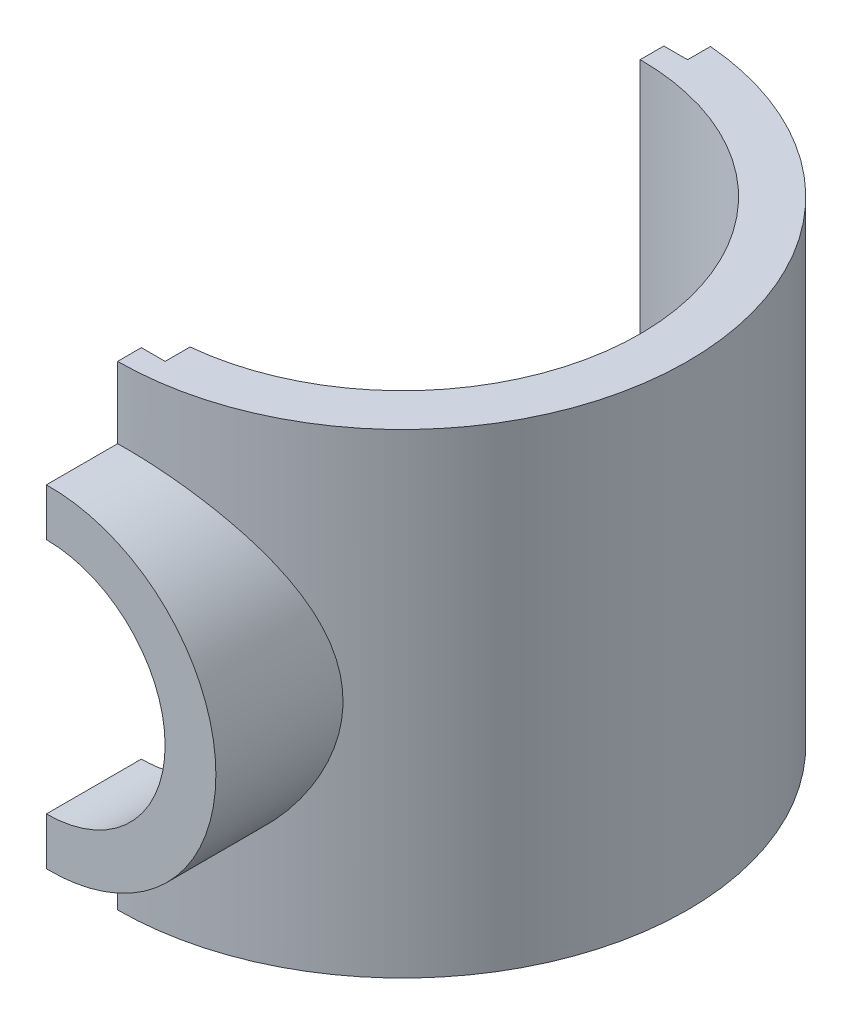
ISO-10303-21;
HEADER;
FILE_DESCRIPTION(('STEP AP214'),'2;1');
FILE_NAME('part.step','',(''),(''),'','','');
FILE_SCHEMA(('AUTOMOTIVE_DESIGN { 1 0 10303 214 1 1 1 1 }'));
ENDSEC;
DATA;
#1=APPLICATION_CONTEXT('core data for automotive mechanical design processes');
#2=APPLICATION_PROTOCOL_DEFINITION('international standard','automotive_design',2000,#1);
#3=PRODUCT_CONTEXT('',#1,'mechanical');
#4=PRODUCT('Part','Part','',(#3));
#5=PRODUCT_RELATED_PRODUCT_CATEGORY('part','',(#4));
#6=PRODUCT_DEFINITION_FORMATION('','',#4);
#7=PRODUCT_DEFINITION_CONTEXT('part definition',#1,'design');
#8=PRODUCT_DEFINITION('design','',#6,#7);
#9=PRODUCT_DEFINITION_SHAPE('','',#8);
#10=(LENGTH_UNIT() NAMED_UNIT(*) SI_UNIT(.MILLI.,.METRE.));
#11=(NAMED_UNIT(*) PLANE_ANGLE_UNIT() SI_UNIT($,.RADIAN.));
#12=(NAMED_UNIT(*) SI_UNIT($,.STERADIAN.) SOLID_ANGLE_UNIT());
#13=UNCERTAINTY_MEASURE_WITH_UNIT(LENGTH_MEASURE(1.E-05),#10,'distance_accuracy_value','');
#14=(GEOMETRIC_REPRESENTATION_CONTEXT(3) GLOBAL_UNCERTAINTY_ASSIGNED_CONTEXT((#13)) GLOBAL_UNIT_ASSIGNED_CONTEXT((#10,
#11,#12)) REPRESENTATION_CONTEXT('',''));
#15=CARTESIAN_POINT('',(0.,0.,0.));
#16=DIRECTION('',(0.,0.,1.));
#17=DIRECTION('',(1.,0.,0.));
#18=AXIS2_PLACEMENT_3D('',#15,#16,#17);
#19=CARTESIAN_POINT('',(0.,20.,10.));
#20=DIRECTION('',(1.,0.,0.));
#21=DIRECTION('',(0.,0.,-1.));
#22=AXIS2_PLACEMENT_3D('',#19,#20,#21);
#23=PLANE('',#22);
#24=DIRECTION('',(0.,1.,0.));
#25=VECTOR('',#24,1.);
#26=CARTESIAN_POINT('',(0.,20.,10.9995625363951));
#27=LINE('',#26,#25);
#28=CARTESIAN_POINT('',(0.,15.,10.9995625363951));
#29=VERTEX_POINT('',#28);
#30=CARTESIAN_POINT('',(0.,20.,10.9995625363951));
#31=VERTEX_POINT('',#30);
#32=EDGE_CURVE('E169',#29,#31,#27,.T.);
#33=ORIENTED_EDGE('',*,*,#32,.F.);
#34=DIRECTION('',(0.,0.,-1.));
#35=VECTOR('',#34,1.);
#36=CARTESIAN_POINT('',(0.,15.,15.));
#37=LINE('',#36,#35);
#38=CARTESIAN_POINT('',(0.,15.,15.));
#39=VERTEX_POINT('',#38);
#40=EDGE_CURVE('E254',#39,#29,#37,.T.);
#41=ORIENTED_EDGE('',*,*,#40,.F.);
#42=DIRECTION('',(0.,-1.,0.));
#43=VECTOR('',#42,1.);
#44=CARTESIAN_POINT('',(0.,16.998648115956,15.));
#45=LINE('',#44,#43);
#46=CARTESIAN_POINT('',(0.,16.998648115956,15.));
#47=VERTEX_POINT('',#46);
#48=EDGE_CURVE('E296',#47,#39,#45,.T.);
#49=ORIENTED_EDGE('',*,*,#48,.F.);
#50=DIRECTION('',(0.,0.,-1.));
#51=VECTOR('',#50,1.);
#52=CARTESIAN_POINT('',(0.,16.998648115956,15.));
#53=LINE('',#52,#51);
#54=CARTESIAN_POINT('',(0.,16.998648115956,12.));
#55=VERTEX_POINT('',#54);
#56=EDGE_CURVE('E217',#47,#55,#53,.T.);
#57=ORIENTED_EDGE('',*,*,#56,.T.);
#58=DIRECTION('',(0.,-1.,0.));
#59=VECTOR('',#58,1.);
#60=CARTESIAN_POINT('',(0.,20.,12.));
#61=LINE('',#60,#59);
#62=CARTESIAN_POINT('',(0.,20.,12.));
#63=VERTEX_POINT('',#62);
#64=EDGE_CURVE('E240',#63,#55,#61,.T.);
#65=ORIENTED_EDGE('',*,*,#64,.F.);
#66=DIRECTION('',(0.,0.,1.));
#67=VECTOR('',#66,1.);
#68=CARTESIAN_POINT('',(0.,20.,10.));
#69=LINE('',#68,#67);
#70=EDGE_CURVE('E222',#31,#63,#69,.T.);
#71=ORIENTED_EDGE('',*,*,#70,.F.);
#72=EDGE_LOOP('',(#33,#41,#49,#57,#65,#71));
#73=FACE_BOUND('',#72,.T.);
#74=ADVANCED_FACE('F33',(#73),#23,.F.);
#75=CARTESIAN_POINT('',(0.,20.,0.));
#76=DIRECTION('',(0.,-1.,0.));
#77=DIRECTION('',(0.,0.,-1.));
#78=AXIS2_PLACEMENT_3D('',#75,#76,#77);
#79=CYLINDRICAL_SURFACE('',#78,10.);
#80=DIRECTION('',(0.,-1.,0.));
#81=VECTOR('',#80,1.);
#82=CARTESIAN_POINT('',(1.,20.,9.9498743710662));
#83=LINE('',#82,#81);
#84=CARTESIAN_POINT('',(1.,20.,9.9498743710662));
#85=VERTEX_POINT('',#84);
#86=CARTESIAN_POINT('',(1.,14.8989794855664,9.9498743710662));
#87=VERTEX_POINT('',#86);
#88=EDGE_CURVE('E171',#85,#87,#83,.T.);
#89=ORIENTED_EDGE('',*,*,#88,.F.);
#90=CARTESIAN_POINT('',(0.,20.,0.));
#91=DIRECTION('',(0.,-1.,0.));
#92=DIRECTION('',(0.,0.,1.));
#93=AXIS2_PLACEMENT_3D('',#90,#91,#92);
#94=CIRCLE('',#93,10.);
#95=CARTESIAN_POINT('',(0.,20.,-10.));
#96=VERTEX_POINT('',#95);
#97=EDGE_CURVE('E219',#96,#85,#94,.T.);
#98=ORIENTED_EDGE('',*,*,#97,.F.);
#99=DIRECTION('',(0.,-1.,0.));
#100=VECTOR('',#99,1.);
#101=CARTESIAN_POINT('',(0.,20.,-10.));
#102=LINE('',#101,#100);
#103=CARTESIAN_POINT('',(0.,0.,-10.));
#104=VERTEX_POINT('',#103);
#105=EDGE_CURVE('E228',#96,#104,#102,.T.);
#106=ORIENTED_EDGE('',*,*,#105,.T.);
#107=CARTESIAN_POINT('',(0.,0.,0.));
#108=DIRECTION('',(0.,-1.,0.));
#109=DIRECTION('',(0.,0.,1.));
#110=AXIS2_PLACEMENT_3D('',#107,#108,#109);
#111=CIRCLE('',#110,10.);
#112=CARTESIAN_POINT('',(1.,0.,9.9498743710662));
#113=VERTEX_POINT('',#112);
#114=EDGE_CURVE('E216',#104,#113,#111,.T.);
#115=ORIENTED_EDGE('',*,*,#114,.T.);
#116=CARTESIAN_POINT('',(1.,5.10102051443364,9.9498743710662));
#117=VERTEX_POINT('',#116);
#118=EDGE_CURVE('E173',#117,#113,#83,.T.);
#119=ORIENTED_EDGE('',*,*,#118,.F.);
#120=CARTESIAN_POINT('',(0.,5.,10.));
#121=CARTESIAN_POINT('',(0.131987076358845,4.9999776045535,10.0000241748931));
#122=CARTESIAN_POINT('',(0.2639623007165,5.0052251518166,9.99738782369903));
#123=CARTESIAN_POINT('',(0.526834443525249,5.02609185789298,9.98697207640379));
#124=CARTESIAN_POINT('',(0.657731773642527,5.04170685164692,9.97919474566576));
#125=CARTESIAN_POINT('',(0.916915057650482,5.08304694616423,9.9587210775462));
#126=CARTESIAN_POINT('',(1.04521012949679,5.10872611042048,9.94604709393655));
#127=CARTESIAN_POINT('',(1.29889259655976,5.16989629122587,9.91610743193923));
#128=CARTESIAN_POINT('',(1.42427981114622,5.20538791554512,9.89884146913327));
#129=CARTESIAN_POINT('',(1.67114695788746,5.28575657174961,9.86016491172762));
#130=CARTESIAN_POINT('',(1.79263227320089,5.33061997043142,9.83876034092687));
#131=CARTESIAN_POINT('',(2.03118834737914,5.4293369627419,9.79229658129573));
#132=CARTESIAN_POINT('',(2.14825742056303,5.48319394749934,9.76723601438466));
#133=CARTESIAN_POINT('',(2.49198806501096,5.65765500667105,9.68737302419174));
#134=CARTESIAN_POINT('',(2.7111764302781,5.79115029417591,9.62788876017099));
#135=CARTESIAN_POINT('',(3.13759208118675,6.09761359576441,9.49780310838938));
#136=CARTESIAN_POINT('',(3.34331339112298,6.27246892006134,9.42674891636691));
#137=CARTESIAN_POINT('',(3.7238994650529,6.65261040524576,9.28299460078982));
#138=CARTESIAN_POINT('',(3.89874394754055,6.85791640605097,9.21029343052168));
#139=CARTESIAN_POINT('',(4.22628588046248,7.31247794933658,9.06493777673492));
#140=CARTESIAN_POINT('',(4.37621092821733,7.56390789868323,8.99272491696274));
#141=CARTESIAN_POINT('',(4.56723713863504,7.95992598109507,8.89637237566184));
#142=CARTESIAN_POINT('',(4.62528235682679,8.09512461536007,8.8662414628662));
#143=CARTESIAN_POINT('',(4.72948947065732,8.37100440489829,8.81109555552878));
#144=CARTESIAN_POINT('',(4.77565838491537,8.51168226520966,8.78607754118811));
#145=CARTESIAN_POINT('',(4.85313763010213,8.78899122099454,8.74350585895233));
#146=CARTESIAN_POINT('',(4.88516689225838,8.92536736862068,8.72559744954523));
#147=CARTESIAN_POINT('',(4.93772467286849,9.20091938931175,8.69596394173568));
#148=CARTESIAN_POINT('',(4.95825929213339,9.34009373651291,8.68423556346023));
#149=CARTESIAN_POINT('',(4.98752342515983,9.61999946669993,8.6674619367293));
#150=CARTESIAN_POINT('',(4.99625978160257,9.76072989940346,8.66241281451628));
#151=CARTESIAN_POINT('',(5.00180406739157,10.042497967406,8.65921295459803));
#152=CARTESIAN_POINT('',(4.99861313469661,10.1835355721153,8.66106155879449));
#153=CARTESIAN_POINT('',(4.98145794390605,10.4477049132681,8.67093732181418));
#154=CARTESIAN_POINT('',(4.96883180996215,10.5709552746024,8.67819679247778));
#155=CARTESIAN_POINT('',(4.93454318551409,10.8158265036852,8.69773954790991));
#156=CARTESIAN_POINT('',(4.91287785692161,10.9374468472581,8.71002441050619));
#157=CARTESIAN_POINT('',(4.86076118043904,11.1782043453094,8.73921568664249));
#158=CARTESIAN_POINT('',(4.83031110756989,11.2973418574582,8.75612142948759));
#159=CARTESIAN_POINT('',(4.76094234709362,11.5324738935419,8.79403119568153));
#160=CARTESIAN_POINT('',(4.72202033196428,11.6484671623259,8.8150368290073));
#161=CARTESIAN_POINT('',(4.59108782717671,11.9960036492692,8.88435968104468));
#162=CARTESIAN_POINT('',(4.48609075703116,12.2216871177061,8.93828642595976));
#163=CARTESIAN_POINT('',(4.24519967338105,12.653204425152,9.0551725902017));
#164=CARTESIAN_POINT('',(4.10929093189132,12.8590287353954,9.11813630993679));
#165=CARTESIAN_POINT('',(3.79034940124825,13.2725817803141,9.25565231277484));
#166=CARTESIAN_POINT('',(3.60352713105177,13.4772453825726,9.33066191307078));
#167=CARTESIAN_POINT('',(3.19774809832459,13.8536928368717,9.47738570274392));
#168=CARTESIAN_POINT('',(2.97877409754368,14.0254589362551,9.54909809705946));
#169=CARTESIAN_POINT('',(2.62424290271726,14.2584822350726,9.65036302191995));
#170=CARTESIAN_POINT('',(2.49857972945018,14.3334294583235,9.6837382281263));
#171=CARTESIAN_POINT('',(2.24044358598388,14.4723446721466,9.74669300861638));
#172=CARTESIAN_POINT('',(2.10797363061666,14.5363174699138,9.77627424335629));
#173=CARTESIAN_POINT('',(1.83725781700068,14.6525425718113,9.83074360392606));
#174=CARTESIAN_POINT('',(1.69901955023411,14.7048097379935,9.8556376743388));
#175=CARTESIAN_POINT('',(1.4177375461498,14.7970756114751,9.90001531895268));
#176=CARTESIAN_POINT('',(1.27469565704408,14.8370789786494,9.91950094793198));
#177=CARTESIAN_POINT('',(0.945577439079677,14.9134074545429,9.95691496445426));
#178=CARTESIAN_POINT('',(0.758343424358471,14.9457982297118,9.97299046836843));
#179=CARTESIAN_POINT('',(0.475251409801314,14.9782726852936,9.98915036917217));
#180=CARTESIAN_POINT('',(0.380459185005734,14.9864122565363,9.99321148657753));
#181=CARTESIAN_POINT('',(0.190454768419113,14.9972773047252,9.99863828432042));
#182=CARTESIAN_POINT('',(0.0952424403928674,15.00000087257,10.0000030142));
#183=CARTESIAN_POINT('',(0.,15.,10.));
#184=B_SPLINE_CURVE_WITH_KNOTS('',3,(#120,#121,#122,#123,#124,#125,#126,#127,#128,#129,#130,
#131,#132,#133,#134,#135,#136,#137,#138,#139,#140,#141,#142,#143,#144,#145,#146,#147,#148,#149,
#150,#151,#152,#153,#154,#155,#156,#157,#158,#159,#160,#161,#162,#163,#164,#165,#166,#167,#168,
#169,#170,#171,#172,#173,#174,#175,#176,#177,#178,#179,#180,#181,#182,#183),.UNSPECIFIED.,.F.,
.F.,(4,2,2,2,2,2,2,2,2,2,2,2,2,2,2,2,2,2,2,2,2,2,2,2,2,2,2,2,2,2,2,4),(0.,0.395812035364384,
0.791465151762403,1.1853330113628,1.57922527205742,1.97254847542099,2.36602032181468,
3.15295337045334,3.98708662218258,4.82176575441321,5.72123159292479,6.17125755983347,
6.62101695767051,7.04409748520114,7.4669532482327,7.88956366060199,8.31213375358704,
8.68401829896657,9.05601969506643,9.42796712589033,9.80006091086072,10.5608222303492,
11.3219467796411,12.1795413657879,13.0375974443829,13.4873137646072,13.9368325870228,
14.385777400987,14.834551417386,15.4049367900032,15.6904554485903,15.9760747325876),.UNSPECIFIED.);
#185=EDGE_CURVE('E177',#117,#87,#184,.T.);
#186=ORIENTED_EDGE('',*,*,#185,.T.);
#187=EDGE_LOOP('',(#89,#98,#106,#115,#119,#186));
#188=FACE_BOUND('',#187,.T.);
#189=ADVANCED_FACE('F35',(#188),#79,.F.);
#190=DIRECTION('',(0.,1.,0.));
#191=VECTOR('',#190,1.);
#192=CARTESIAN_POINT('',(0.,20.,10.9995625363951));
#193=LINE('',#192,#191);
#194=CARTESIAN_POINT('',(0.,0.,10.9995625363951));
#195=VERTEX_POINT('',#194);
#196=CARTESIAN_POINT('',(0.,5.,10.9995625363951));
#197=VERTEX_POINT('',#196);
#198=EDGE_CURVE('E147',#195,#197,#193,.T.);
#199=ORIENTED_EDGE('',*,*,#198,.F.);
#200=DIRECTION('',(0.,0.,1.));
#201=VECTOR('',#200,1.);
#202=CARTESIAN_POINT('',(0.,0.,10.));
#203=LINE('',#202,#201);
#204=CARTESIAN_POINT('',(0.,0.,12.));
#205=VERTEX_POINT('',#204);
#206=EDGE_CURVE('E231',#195,#205,#203,.T.);
#207=ORIENTED_EDGE('',*,*,#206,.T.);
#208=CARTESIAN_POINT('',(0.,3.00135188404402,12.));
#209=VERTEX_POINT('',#208);
#210=EDGE_CURVE('E239',#209,#205,#61,.T.);
#211=ORIENTED_EDGE('',*,*,#210,.F.);
#212=DIRECTION('',(0.,0.,-1.));
#213=VECTOR('',#212,1.);
#214=CARTESIAN_POINT('',(0.,3.00135188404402,15.));
#215=LINE('',#214,#213);
#216=CARTESIAN_POINT('',(0.,3.00135188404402,15.));
#217=VERTEX_POINT('',#216);
#218=EDGE_CURVE('E289',#217,#209,#215,.T.);
#219=ORIENTED_EDGE('',*,*,#218,.F.);
#220=DIRECTION('',(0.,-1.,0.));
#221=VECTOR('',#220,1.);
#222=CARTESIAN_POINT('',(0.,5.,15.));
#223=LINE('',#222,#221);
#224=CARTESIAN_POINT('',(0.,5.,15.));
#225=VERTEX_POINT('',#224);
#226=EDGE_CURVE('E288',#225,#217,#223,.T.);
#227=ORIENTED_EDGE('',*,*,#226,.F.);
#228=DIRECTION('',(0.,0.,-1.));
#229=VECTOR('',#228,1.);
#230=CARTESIAN_POINT('',(0.,5.,15.));
#231=LINE('',#230,#229);
#232=EDGE_CURVE('E281',#225,#197,#231,.T.);
#233=ORIENTED_EDGE('',*,*,#232,.T.);
#234=EDGE_LOOP('',(#199,#207,#211,#219,#227,#233));
#235=FACE_BOUND('',#234,.T.);
#236=ADVANCED_FACE('F286',(#235),#23,.F.);
#237=CARTESIAN_POINT('',(0.,20.,0.));
#238=DIRECTION('',(0.,-1.,0.));
#239=DIRECTION('',(0.,0.,-1.));
#240=AXIS2_PLACEMENT_3D('',#237,#238,#239);
#241=CYLINDRICAL_SURFACE('',#240,12.);
#242=DIRECTION('',(0.,-1.,0.));
#243=VECTOR('',#242,1.);
#244=CARTESIAN_POINT('',(1.,20.,-11.9582607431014));
#245=LINE('',#244,#243);
#246=CARTESIAN_POINT('',(1.,20.,-11.9582607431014));
#247=VERTEX_POINT('',#246);
#248=CARTESIAN_POINT('',(1.,0.,-11.9582607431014));
#249=VERTEX_POINT('',#248);
#250=EDGE_CURVE('E175',#247,#249,#245,.T.);
#251=ORIENTED_EDGE('',*,*,#250,.F.);
#252=CARTESIAN_POINT('',(0.,20.,0.));
#253=DIRECTION('',(0.,1.,0.));
#254=DIRECTION('',(0.,0.,1.));
#255=AXIS2_PLACEMENT_3D('',#252,#253,#254);
#256=CIRCLE('',#255,12.);
#257=EDGE_CURVE('E152',#63,#247,#256,.T.);
#258=ORIENTED_EDGE('',*,*,#257,.F.);
#259=ORIENTED_EDGE('',*,*,#64,.T.);
#260=CARTESIAN_POINT('',(0.,3.00135188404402,12.));
#261=CARTESIAN_POINT('',(0.180325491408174,2.99777360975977,12.0000367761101));
#262=CARTESIAN_POINT('',(0.36077167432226,3.00123102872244,11.9959367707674));
#263=CARTESIAN_POINT('',(0.720420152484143,3.02199289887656,11.9796972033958));
#264=CARTESIAN_POINT('',(0.899622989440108,3.03929088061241,11.9675613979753));
#265=CARTESIAN_POINT('',(1.25452167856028,3.08737801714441,11.9355693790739));
#266=CARTESIAN_POINT('',(1.43023113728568,3.11809472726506,11.9157546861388));
#267=CARTESIAN_POINT('',(1.77787507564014,3.19257846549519,11.8688633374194));
#268=CARTESIAN_POINT('',(1.94980927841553,3.23634644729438,11.8417861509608));
#269=CARTESIAN_POINT('',(2.28848357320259,3.33631708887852,11.7810179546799));
#270=CARTESIAN_POINT('',(2.45523225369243,3.39249778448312,11.7473386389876));
#271=CARTESIAN_POINT('',(2.78292915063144,3.51672876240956,11.6740546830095));
#272=CARTESIAN_POINT('',(2.94387509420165,3.58478363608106,11.6344477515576));
#273=CARTESIAN_POINT('',(3.41695165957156,3.8059144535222,11.507857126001));
#274=CARTESIAN_POINT('',(3.71927998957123,3.97594431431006,11.4131112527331));
#275=CARTESIAN_POINT('',(4.31302273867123,4.36957274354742,11.202870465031));
#276=CARTESIAN_POINT('',(4.60207997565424,4.59614901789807,11.0863722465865));
#277=CARTESIAN_POINT('',(5.14047439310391,5.09036788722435,10.8472237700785));
#278=CARTESIAN_POINT('',(5.38976913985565,5.35805376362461,10.7245671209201));
#279=CARTESIAN_POINT('',(5.74454120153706,5.80430498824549,10.5366584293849));
#280=CARTESIAN_POINT('',(5.86512575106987,5.97043611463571,10.4698337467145));
#281=CARTESIAN_POINT('',(6.09182603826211,6.31366400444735,10.3395704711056));
#282=CARTESIAN_POINT('',(6.19793946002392,6.49076251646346,10.2761324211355));
#283=CARTESIAN_POINT('',(6.39466440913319,6.85492213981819,10.1548814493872));
#284=CARTESIAN_POINT('',(6.48529382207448,7.0419714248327,10.0970620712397));
#285=CARTESIAN_POINT('',(6.65019642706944,7.42528849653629,9.98922419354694));
#286=CARTESIAN_POINT('',(6.7244752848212,7.62155306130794,9.9392029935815));
#287=CARTESIAN_POINT('',(6.84038256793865,7.97553883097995,9.85965991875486));
#288=CARTESIAN_POINT('',(6.8855877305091,8.13163322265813,9.82807480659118));
#289=CARTESIAN_POINT('',(6.96523588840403,8.44774905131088,9.77178960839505));
#290=CARTESIAN_POINT('',(6.99968122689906,8.60776962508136,9.74708802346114));
#291=CARTESIAN_POINT('',(7.05734654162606,8.93064997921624,9.70541747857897));
#292=CARTESIAN_POINT('',(7.08057810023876,9.09350664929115,9.68844054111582));
#293=CARTESIAN_POINT('',(7.11553336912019,9.42111128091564,9.66279764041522));
#294=CARTESIAN_POINT('',(7.12725691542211,9.585859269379,9.65413179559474));
#295=CARTESIAN_POINT('',(7.13902580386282,9.91641475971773,9.6454323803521));
#296=CARTESIAN_POINT('',(7.13904193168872,10.0822238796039,9.64542040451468));
#297=CARTESIAN_POINT('',(7.12732264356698,10.4131955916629,9.65408326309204));
#298=CARTESIAN_POINT('',(7.11558718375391,10.57835818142,9.66275812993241));
#299=CARTESIAN_POINT('',(7.08054307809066,10.9068477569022,9.68846626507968));
#300=CARTESIAN_POINT('',(7.05723007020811,11.070174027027,9.70550268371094));
#301=CARTESIAN_POINT('',(6.99935758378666,11.3938692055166,9.74732085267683));
#302=CARTESIAN_POINT('',(6.9647935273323,11.5542368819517,9.77210575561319));
#303=CARTESIAN_POINT('',(6.8858490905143,11.8671014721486,9.82788661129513));
#304=CARTESIAN_POINT('',(6.84173132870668,12.0196949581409,9.85871463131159));
#305=CARTESIAN_POINT('',(6.74367299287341,12.3204293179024,9.92604691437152));
#306=CARTESIAN_POINT('',(6.68972921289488,12.4685687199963,9.96255302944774));
#307=CARTESIAN_POINT('',(6.51387357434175,12.9053723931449,10.0791493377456));
#308=CARTESIAN_POINT('',(6.37789731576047,13.1865786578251,10.1663470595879));
#309=CARTESIAN_POINT('',(6.04668487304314,13.7699650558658,10.3672978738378));
#310=CARTESIAN_POINT('',(5.84538401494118,14.0680056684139,10.4830603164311));
#311=CARTESIAN_POINT('',(5.51204738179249,14.4885430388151,10.659890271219));
#312=CARTESIAN_POINT('',(5.39560948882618,14.624389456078,10.7194084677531));
#313=CARTESIAN_POINT('',(5.15260030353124,14.8868614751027,10.8383110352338));
#314=CARTESIAN_POINT('',(5.02602731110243,15.0134855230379,10.8976953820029));
#315=CARTESIAN_POINT('',(4.74395459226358,15.2747861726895,11.0237073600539));
#316=CARTESIAN_POINT('',(4.58693313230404,15.4079266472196,11.090122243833));
#317=CARTESIAN_POINT('',(4.26090585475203,15.6604387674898,11.2194215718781));
#318=CARTESIAN_POINT('',(4.09190406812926,15.7798150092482,11.2823071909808));
#319=CARTESIAN_POINT('',(3.74257913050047,16.0039121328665,11.4029495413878));
#320=CARTESIAN_POINT('',(3.56225084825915,16.1086263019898,11.4607039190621));
#321=CARTESIAN_POINT('',(3.19135831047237,16.3022297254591,11.5694667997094));
#322=CARTESIAN_POINT('',(3.00079556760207,16.3911213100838,11.620476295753));
#323=CARTESIAN_POINT('',(2.61993026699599,16.5481498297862,11.7120660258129));
#324=CARTESIAN_POINT('',(2.43004252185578,16.6170701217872,11.7530256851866));
#325=CARTESIAN_POINT('',(2.04351336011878,16.7385745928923,11.8263572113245));
#326=CARTESIAN_POINT('',(1.84687321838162,16.7911618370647,11.8587306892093));
#327=CARTESIAN_POINT('',(1.44901683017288,16.8790622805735,11.9138818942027));
#328=CARTESIAN_POINT('',(1.24781437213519,16.9144217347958,11.9366852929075));
#329=CARTESIAN_POINT('',(0.842319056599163,16.9674287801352,11.9721277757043));
#330=CARTESIAN_POINT('',(0.638028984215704,16.9850914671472,11.9847755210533));
#331=CARTESIAN_POINT('',(0.361083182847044,16.9968044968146,11.9947845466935));
#332=CARTESIAN_POINT('',(0.288845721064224,16.9987386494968,11.9967411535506));
#333=CARTESIAN_POINT('',(0.144401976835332,17.0003684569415,11.9993480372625));
#334=CARTESIAN_POINT('',(0.0721957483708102,17.0000665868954,11.9999997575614));
#335=CARTESIAN_POINT('',(0.,16.998648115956,12.));
#336=B_SPLINE_CURVE_WITH_KNOTS('',3,(#260,#261,#262,#263,#264,#265,#266,#267,#268,#269,#270,
#271,#272,#273,#274,#275,#276,#277,#278,#279,#280,#281,#282,#283,#284,#285,#286,#287,#288,#289,
#290,#291,#292,#293,#294,#295,#296,#297,#298,#299,#300,#301,#302,#303,#304,#305,#306,#307,#308,
#309,#310,#311,#312,#313,#314,#315,#316,#317,#318,#319,#320,#321,#322,#323,#324,#325,#326,#327,
#328,#329,#330,#331,#332,#333,#334,#335),.UNSPECIFIED.,.F.,.F.,(4,2,2,2,2,2,2,2,2,2,2,2,2,2,2,2,
2,2,2,2,2,2,2,2,2,2,2,2,2,2,2,2,2,2,2,2,2,4),(0.,0.540872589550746,1.08149250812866,
1.61922913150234,2.15700505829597,2.69383691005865,3.23087679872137,4.3050856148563,
5.45671852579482,6.60957232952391,7.25656483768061,7.90366076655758,8.55000410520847,
9.19612312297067,9.69227945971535,10.1883276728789,10.6838624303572,11.1794042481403,
11.6761826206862,12.1729628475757,12.6699303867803,13.1671003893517,13.6520305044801,
14.1371191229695,15.1068083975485,16.2357430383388,16.8010217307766,17.3663954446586,
18.0145611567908,18.6625098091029,19.3107541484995,19.9589029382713,20.5763660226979,
21.1937131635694,21.8093935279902,22.424548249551,22.6413828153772,22.8579773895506),.UNSPECIFIED.);
#337=EDGE_CURVE('E209',#209,#55,#336,.T.);
#338=ORIENTED_EDGE('',*,*,#337,.F.);
#339=ORIENTED_EDGE('',*,*,#210,.T.);
#340=CARTESIAN_POINT('',(0.,0.,0.));
#341=DIRECTION('',(0.,1.,0.));
#342=DIRECTION('',(0.,0.,1.));
#343=AXIS2_PLACEMENT_3D('',#340,#341,#342);
#344=CIRCLE('',#343,12.);
#345=EDGE_CURVE('E233',#205,#249,#344,.T.);
#346=ORIENTED_EDGE('',*,*,#345,.T.);
#347=EDGE_LOOP('',(#251,#258,#259,#338,#339,#346));
#348=FACE_BOUND('',#347,.T.);
#349=ADVANCED_FACE('F303',(#348),#241,.T.);
#350=CARTESIAN_POINT('',(0.,20.,-10.));
#351=DIRECTION('',(1.,0.,0.));
#352=DIRECTION('',(0.,0.,-1.));
#353=AXIS2_PLACEMENT_3D('',#350,#351,#352);
#354=PLANE('',#353);
#355=DIRECTION('',(0.,1.,0.));
#356=VECTOR('',#355,1.);
#357=CARTESIAN_POINT('',(0.,20.,-10.9951309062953));
#358=LINE('',#357,#356);
#359=CARTESIAN_POINT('',(0.,0.,-10.9951309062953));
#360=VERTEX_POINT('',#359);
#361=CARTESIAN_POINT('',(0.,20.,-10.9951309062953));
#362=VERTEX_POINT('',#361);
#363=EDGE_CURVE('E139',#360,#362,#358,.T.);
#364=ORIENTED_EDGE('',*,*,#363,.F.);
#365=DIRECTION('',(0.,0.,1.));
#366=VECTOR('',#365,1.);
#367=CARTESIAN_POINT('',(0.,0.,-10.));
#368=LINE('',#367,#366);
#369=EDGE_CURVE('E223',#360,#104,#368,.T.);
#370=ORIENTED_EDGE('',*,*,#369,.T.);
#371=ORIENTED_EDGE('',*,*,#105,.F.);
#372=DIRECTION('',(0.,0.,1.));
#373=VECTOR('',#372,1.);
#374=CARTESIAN_POINT('',(0.,20.,-10.));
#375=LINE('',#374,#373);
#376=EDGE_CURVE('E226',#362,#96,#375,.T.);
#377=ORIENTED_EDGE('',*,*,#376,.F.);
#378=EDGE_LOOP('',(#364,#370,#371,#377));
#379=FACE_BOUND('',#378,.T.);
#380=ADVANCED_FACE('F271',(#379),#354,.F.);
#381=CARTESIAN_POINT('',(0.,20.,0.));
#382=DIRECTION('',(0.,1.,0.));
#383=DIRECTION('',(0.,0.,1.));
#384=AXIS2_PLACEMENT_3D('',#381,#382,#383);
#385=PLANE('',#384);
#386=ORIENTED_EDGE('',*,*,#257,.T.);
#387=DIRECTION('',(0.,0.,-1.));
#388=VECTOR('',#387,1.);
#389=CARTESIAN_POINT('',(1.,20.,-12.0623394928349));
#390=LINE('',#389,#388);
#391=CARTESIAN_POINT('',(1.,20.,-10.9951309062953));
#392=VERTEX_POINT('',#391);
#393=EDGE_CURVE('E143',#392,#247,#390,.T.);
#394=ORIENTED_EDGE('',*,*,#393,.F.);
#395=DIRECTION('',(1.,0.,0.));
#396=VECTOR('',#395,1.);
#397=CARTESIAN_POINT('',(1.,20.,-10.9951309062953));
#398=LINE('',#397,#396);
#399=EDGE_CURVE('E134',#362,#392,#398,.T.);
#400=ORIENTED_EDGE('',*,*,#399,.F.);
#401=ORIENTED_EDGE('',*,*,#376,.T.);
#402=ORIENTED_EDGE('',*,*,#97,.T.);
#403=DIRECTION('',(0.,0.,-1.));
#404=VECTOR('',#403,1.);
#405=CARTESIAN_POINT('',(1.,20.,8.9995625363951));
#406=LINE('',#405,#404);
#407=CARTESIAN_POINT('',(1.,20.,10.9995625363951));
#408=VERTEX_POINT('',#407);
#409=EDGE_CURVE('E156',#408,#85,#406,.T.);
#410=ORIENTED_EDGE('',*,*,#409,.F.);
#411=DIRECTION('',(1.,0.,0.));
#412=VECTOR('',#411,1.);
#413=CARTESIAN_POINT('',(1.,20.,10.9995625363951));
#414=LINE('',#413,#412);
#415=EDGE_CURVE('E158',#31,#408,#414,.T.);
#416=ORIENTED_EDGE('',*,*,#415,.F.);
#417=ORIENTED_EDGE('',*,*,#70,.T.);
#418=EDGE_LOOP('',(#386,#394,#400,#401,#402,#410,#416,#417));
#419=FACE_BOUND('',#418,.T.);
#420=ADVANCED_FACE('F150',(#419),#385,.T.);
#421=CARTESIAN_POINT('',(0.,0.,0.));
#422=DIRECTION('',(0.,1.,0.));
#423=DIRECTION('',(0.,0.,1.));
#424=AXIS2_PLACEMENT_3D('',#421,#422,#423);
#425=PLANE('',#424);
#426=DIRECTION('',(0.,0.,-1.));
#427=VECTOR('',#426,1.);
#428=CARTESIAN_POINT('',(1.,0.,-12.0623394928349));
#429=LINE('',#428,#427);
#430=CARTESIAN_POINT('',(1.,0.,-10.9951309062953));
#431=VERTEX_POINT('',#430);
#432=EDGE_CURVE('E49',#431,#249,#429,.T.);
#433=ORIENTED_EDGE('',*,*,#432,.T.);
#434=ORIENTED_EDGE('',*,*,#345,.F.);
#435=ORIENTED_EDGE('',*,*,#206,.F.);
#436=DIRECTION('',(1.,0.,0.));
#437=VECTOR('',#436,1.);
#438=CARTESIAN_POINT('',(1.,0.,10.9995625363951));
#439=LINE('',#438,#437);
#440=CARTESIAN_POINT('',(1.,0.,10.9995625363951));
#441=VERTEX_POINT('',#440);
#442=EDGE_CURVE('E159',#195,#441,#439,.T.);
#443=ORIENTED_EDGE('',*,*,#442,.T.);
#444=DIRECTION('',(0.,0.,-1.));
#445=VECTOR('',#444,1.);
#446=CARTESIAN_POINT('',(1.,0.,8.9995625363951));
#447=LINE('',#446,#445);
#448=EDGE_CURVE('E162',#441,#113,#447,.T.);
#449=ORIENTED_EDGE('',*,*,#448,.T.);
#450=ORIENTED_EDGE('',*,*,#114,.F.);
#451=ORIENTED_EDGE('',*,*,#369,.F.);
#452=DIRECTION('',(-1.,0.,0.));
#453=VECTOR('',#452,1.);
#454=CARTESIAN_POINT('',(0.,0.,-10.9951309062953));
#455=LINE('',#454,#453);
#456=EDGE_CURVE('E11',#431,#360,#455,.T.);
#457=ORIENTED_EDGE('',*,*,#456,.F.);
#458=EDGE_LOOP('',(#433,#434,#435,#443,#449,#450,#451,#457));
#459=FACE_BOUND('',#458,.T.);
#460=ADVANCED_FACE('F200',(#459),#425,.F.);
#461=CARTESIAN_POINT('',(0.,10.,-12.001));
#462=DIRECTION('',(0.,0.,1.));
#463=DIRECTION('',(1.,0.,0.));
#464=AXIS2_PLACEMENT_3D('',#461,#462,#463);
#465=CYLINDRICAL_SURFACE('',#464,5.);
#466=CARTESIAN_POINT('',(0.,10.,10.9995625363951));
#467=DIRECTION('',(0.,0.,-1.));
#468=DIRECTION('',(-1.,0.,0.));
#469=AXIS2_PLACEMENT_3D('',#466,#467,#468);
#470=CIRCLE('',#469,5.);
#471=CARTESIAN_POINT('',(1.,14.8989794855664,10.9995625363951));
#472=VERTEX_POINT('',#471);
#473=EDGE_CURVE('E246',#29,#472,#470,.T.);
#474=ORIENTED_EDGE('',*,*,#473,.T.);
#475=DIRECTION('',(0.,0.,1.));
#476=VECTOR('',#475,1.);
#477=CARTESIAN_POINT('',(1.,14.8989794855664,-12.001));
#478=LINE('',#477,#476);
#479=EDGE_CURVE('E42',#472,#87,#478,.F.);
#480=ORIENTED_EDGE('',*,*,#479,.T.);
#481=ORIENTED_EDGE('',*,*,#185,.F.);
#482=DIRECTION('',(0.,0.,1.));
#483=VECTOR('',#482,1.);
#484=CARTESIAN_POINT('',(1.,5.10102051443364,-12.001));
#485=LINE('',#484,#483);
#486=CARTESIAN_POINT('',(1.,5.10102051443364,10.9995625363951));
#487=VERTEX_POINT('',#486);
#488=EDGE_CURVE('E245',#117,#487,#485,.T.);
#489=ORIENTED_EDGE('',*,*,#488,.T.);
#490=EDGE_CURVE('E242',#487,#197,#470,.T.);
#491=ORIENTED_EDGE('',*,*,#490,.T.);
#492=ORIENTED_EDGE('',*,*,#232,.F.);
#493=CARTESIAN_POINT('',(0.,10.,15.));
#494=DIRECTION('',(0.,0.,-1.));
#495=DIRECTION('',(1.,0.,0.));
#496=AXIS2_PLACEMENT_3D('',#493,#494,#495);
#497=CIRCLE('',#496,5.);
#498=EDGE_CURVE('E295',#39,#225,#497,.T.);
#499=ORIENTED_EDGE('',*,*,#498,.F.);
#500=ORIENTED_EDGE('',*,*,#40,.T.);
#501=EDGE_LOOP('',(#474,#480,#481,#489,#491,#492,#499,#500));
#502=FACE_BOUND('',#501,.T.);
#503=ADVANCED_FACE('F197',(#502),#465,.F.);
#504=CARTESIAN_POINT('',(0.137566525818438,10.,-12.001));
#505=DIRECTION('',(0.,0.,1.));
#506=DIRECTION('',(1.,0.,0.));
#507=AXIS2_PLACEMENT_3D('',#504,#505,#506);
#508=CYLINDRICAL_SURFACE('',#507,7.);
#509=ORIENTED_EDGE('',*,*,#337,.T.);
#510=ORIENTED_EDGE('',*,*,#56,.F.);
#511=CARTESIAN_POINT('',(0.137566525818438,10.,15.));
#512=DIRECTION('',(0.,0.,1.));
#513=DIRECTION('',(-1.,0.,0.));
#514=AXIS2_PLACEMENT_3D('',#511,#512,#513);
#515=CIRCLE('',#514,7.);
#516=EDGE_CURVE('E184',#217,#47,#515,.T.);
#517=ORIENTED_EDGE('',*,*,#516,.F.);
#518=ORIENTED_EDGE('',*,*,#218,.T.);
#519=EDGE_LOOP('',(#509,#510,#517,#518));
#520=FACE_BOUND('',#519,.T.);
#521=ADVANCED_FACE('F195',(#520),#508,.T.);
#522=CARTESIAN_POINT('',(0.137566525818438,10.,15.));
#523=DIRECTION('',(0.,0.,-1.));
#524=DIRECTION('',(-1.,0.,0.));
#525=AXIS2_PLACEMENT_3D('',#522,#523,#524);
#526=PLANE('',#525);
#527=ORIENTED_EDGE('',*,*,#516,.T.);
#528=ORIENTED_EDGE('',*,*,#48,.T.);
#529=ORIENTED_EDGE('',*,*,#498,.T.);
#530=ORIENTED_EDGE('',*,*,#226,.T.);
#531=EDGE_LOOP('',(#527,#528,#529,#530));
#532=FACE_BOUND('',#531,.T.);
#533=ADVANCED_FACE('F191',(#532),#526,.F.);
#534=CARTESIAN_POINT('',(1.,20.,10.9995625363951));
#535=DIRECTION('',(0.,0.,-1.));
#536=DIRECTION('',(-1.,0.,0.));
#537=AXIS2_PLACEMENT_3D('',#534,#535,#536);
#538=PLANE('',#537);
#539=ORIENTED_EDGE('',*,*,#198,.T.);
#540=ORIENTED_EDGE('',*,*,#490,.F.);
#541=DIRECTION('',(0.,-1.,0.));
#542=VECTOR('',#541,1.);
#543=CARTESIAN_POINT('',(1.,20.,10.9995625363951));
#544=LINE('',#543,#542);
#545=EDGE_CURVE('E161',#487,#441,#544,.T.);
#546=ORIENTED_EDGE('',*,*,#545,.T.);
#547=ORIENTED_EDGE('',*,*,#442,.F.);
#548=EDGE_LOOP('',(#539,#540,#546,#547));
#549=FACE_BOUND('',#548,.T.);
#550=ADVANCED_FACE('F194',(#549),#538,.T.);
#551=CARTESIAN_POINT('',(1.,20.,8.9995625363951));
#552=DIRECTION('',(-1.,0.,0.));
#553=DIRECTION('',(0.,0.,1.));
#554=AXIS2_PLACEMENT_3D('',#551,#552,#553);
#555=PLANE('',#554);
#556=ORIENTED_EDGE('',*,*,#118,.T.);
#557=ORIENTED_EDGE('',*,*,#448,.F.);
#558=ORIENTED_EDGE('',*,*,#545,.F.);
#559=ORIENTED_EDGE('',*,*,#488,.F.);
#560=EDGE_LOOP('',(#556,#557,#558,#559));
#561=FACE_BOUND('',#560,.T.);
#562=ADVANCED_FACE('F189',(#561),#555,.T.);
#563=ORIENTED_EDGE('',*,*,#88,.T.);
#564=ORIENTED_EDGE('',*,*,#479,.F.);
#565=EDGE_CURVE('E57',#408,#472,#544,.T.);
#566=ORIENTED_EDGE('',*,*,#565,.F.);
#567=ORIENTED_EDGE('',*,*,#409,.T.);
#568=EDGE_LOOP('',(#563,#564,#566,#567));
#569=FACE_BOUND('',#568,.T.);
#570=ADVANCED_FACE('F264',(#569),#555,.T.);
#571=ORIENTED_EDGE('',*,*,#32,.T.);
#572=ORIENTED_EDGE('',*,*,#415,.T.);
#573=ORIENTED_EDGE('',*,*,#565,.T.);
#574=ORIENTED_EDGE('',*,*,#473,.F.);
#575=EDGE_LOOP('',(#571,#572,#573,#574));
#576=FACE_BOUND('',#575,.T.);
#577=ADVANCED_FACE('F256',(#576),#538,.T.);
#578=CARTESIAN_POINT('',(1.,20.,-12.0623394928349));
#579=DIRECTION('',(-1.,0.,0.));
#580=DIRECTION('',(0.,0.,1.));
#581=AXIS2_PLACEMENT_3D('',#578,#579,#580);
#582=PLANE('',#581);
#583=ORIENTED_EDGE('',*,*,#250,.T.);
#584=ORIENTED_EDGE('',*,*,#432,.F.);
#585=DIRECTION('',(0.,-1.,0.));
#586=VECTOR('',#585,1.);
#587=CARTESIAN_POINT('',(1.,20.,-10.9951309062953));
#588=LINE('',#587,#586);
#589=EDGE_CURVE('E136',#392,#431,#588,.T.);
#590=ORIENTED_EDGE('',*,*,#589,.F.);
#591=ORIENTED_EDGE('',*,*,#393,.T.);
#592=EDGE_LOOP('',(#583,#584,#590,#591));
#593=FACE_BOUND('',#592,.T.);
#594=ADVANCED_FACE('F145',(#593),#582,.T.);
#595=CARTESIAN_POINT('',(1.,20.,-10.9951309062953));
#596=DIRECTION('',(0.,0.,-1.));
#597=DIRECTION('',(-1.,0.,0.));
#598=AXIS2_PLACEMENT_3D('',#595,#596,#597);
#599=PLANE('',#598);
#600=ORIENTED_EDGE('',*,*,#363,.T.);
#601=ORIENTED_EDGE('',*,*,#399,.T.);
#602=ORIENTED_EDGE('',*,*,#589,.T.);
#603=ORIENTED_EDGE('',*,*,#456,.T.);
#604=EDGE_LOOP('',(#600,#601,#602,#603));
#605=FACE_BOUND('',#604,.T.);
#606=ADVANCED_FACE('F135',(#605),#599,.T.);
#607=CLOSED_SHELL('',(#74,#189,#236,#349,#380,#420,#460,#503,#521,#533,#550,#562,#570,#577,#594,#606));
#608=MANIFOLD_SOLID_BREP('B2',#607);
#609=ADVANCED_BREP_SHAPE_REPRESENTATION('',(#18,#608),#14);
#610=SHAPE_DEFINITION_REPRESENTATION(#9,#609);
ENDSEC;
END-ISO-10303-21;
